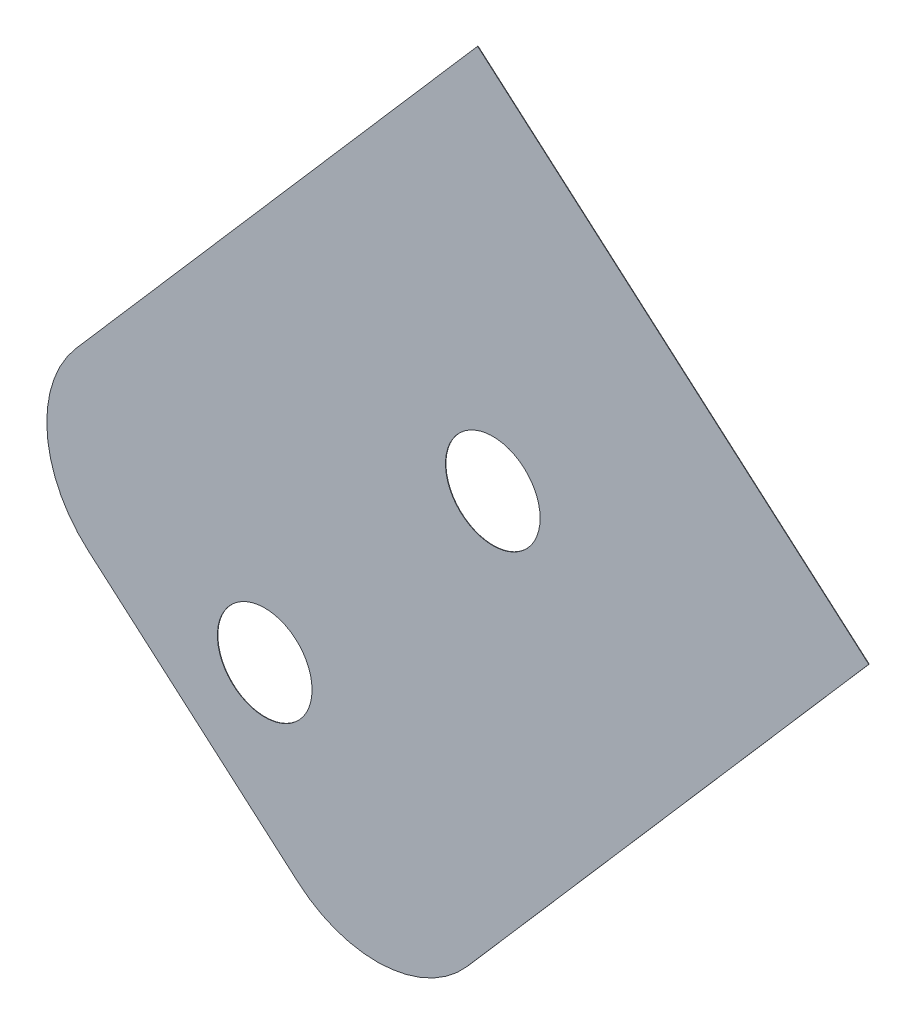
ISO-10303-21;
HEADER;
FILE_DESCRIPTION(('STEP AP214'),'2;1');
FILE_NAME('part.step','',(''),(''),'','','');
FILE_SCHEMA(('AUTOMOTIVE_DESIGN { 1 0 10303 214 1 1 1 1 }'));
ENDSEC;
DATA;
#1=APPLICATION_CONTEXT('core data for automotive mechanical design processes');
#2=APPLICATION_PROTOCOL_DEFINITION('international standard','automotive_design',2000,#1);
#3=PRODUCT_CONTEXT('',#1,'mechanical');
#4=PRODUCT('Part','Part','',(#3));
#5=PRODUCT_RELATED_PRODUCT_CATEGORY('part','',(#4));
#6=PRODUCT_DEFINITION_FORMATION('','',#4);
#7=PRODUCT_DEFINITION_CONTEXT('part definition',#1,'design');
#8=PRODUCT_DEFINITION('design','',#6,#7);
#9=PRODUCT_DEFINITION_SHAPE('','',#8);
#10=(LENGTH_UNIT() NAMED_UNIT(*) SI_UNIT(.MILLI.,.METRE.));
#11=(NAMED_UNIT(*) PLANE_ANGLE_UNIT() SI_UNIT($,.RADIAN.));
#12=(NAMED_UNIT(*) SI_UNIT($,.STERADIAN.) SOLID_ANGLE_UNIT());
#13=UNCERTAINTY_MEASURE_WITH_UNIT(LENGTH_MEASURE(1.E-05),#10,'distance_accuracy_value','');
#14=(GEOMETRIC_REPRESENTATION_CONTEXT(3) GLOBAL_UNCERTAINTY_ASSIGNED_CONTEXT((#13)) GLOBAL_UNIT_ASSIGNED_CONTEXT((#10,
#11,#12)) REPRESENTATION_CONTEXT('',''));
#15=CARTESIAN_POINT('',(0.,0.,0.));
#16=DIRECTION('',(0.,0.,1.));
#17=DIRECTION('',(1.,0.,0.));
#18=AXIS2_PLACEMENT_3D('',#15,#16,#17);
#19=CARTESIAN_POINT('',(-682.910085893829,-108.748616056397,0.0254000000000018));
#20=DIRECTION('',(-0.755030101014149,0.655690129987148,0.));
#21=DIRECTION('',(-0.655690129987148,-0.755030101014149,0.));
#22=AXIS2_PLACEMENT_3D('',#19,#20,#21);
#23=PLANE('',#22);
#24=DIRECTION('',(0.655690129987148,0.755030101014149,0.));
#25=VECTOR('',#24,1.);
#26=CARTESIAN_POINT('',(-682.910085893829,-108.748616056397,0.));
#27=LINE('',#26,#25);
#28=CARTESIAN_POINT('',(-682.910085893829,-108.748616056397,0.));
#29=VERTEX_POINT('',#28);
#30=CARTESIAN_POINT('',(-659.094108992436,-81.3244127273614,0.));
#31=VERTEX_POINT('',#30);
#32=EDGE_CURVE('E135',#29,#31,#27,.T.);
#33=ORIENTED_EDGE('',*,*,#32,.T.);
#34=DIRECTION('',(0.,0.,-1.));
#35=VECTOR('',#34,1.);
#36=CARTESIAN_POINT('',(-659.094108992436,-81.3244127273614,0.0254000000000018));
#37=LINE('',#36,#35);
#38=CARTESIAN_POINT('',(-659.094108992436,-81.3244127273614,0.0254000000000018));
#39=VERTEX_POINT('',#38);
#40=EDGE_CURVE('E11',#39,#31,#37,.T.);
#41=ORIENTED_EDGE('',*,*,#40,.F.);
#42=DIRECTION('',(0.655690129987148,0.755030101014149,0.));
#43=VECTOR('',#42,1.);
#44=CARTESIAN_POINT('',(-682.910085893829,-108.748616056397,0.0254000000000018));
#45=LINE('',#44,#43);
#46=CARTESIAN_POINT('',(-682.910085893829,-108.748616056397,0.0254000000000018));
#47=VERTEX_POINT('',#46);
#48=EDGE_CURVE('E152',#47,#39,#45,.T.);
#49=ORIENTED_EDGE('',*,*,#48,.F.);
#50=DIRECTION('',(0.,0.,-1.));
#51=VECTOR('',#50,1.);
#52=CARTESIAN_POINT('',(-682.910085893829,-108.748616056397,0.0254000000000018));
#53=LINE('',#52,#51);
#54=EDGE_CURVE('E131',#47,#29,#53,.T.);
#55=ORIENTED_EDGE('',*,*,#54,.T.);
#56=EDGE_LOOP('',(#33,#41,#49,#55));
#57=FACE_BOUND('',#56,.T.);
#58=ADVANCED_FACE('F45',(#57),#23,.F.);
#59=CARTESIAN_POINT('',(-659.094108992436,-81.3244127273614,0.0254000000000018));
#60=DIRECTION('',(-0.655690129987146,-0.755030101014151,0.));
#61=DIRECTION('',(0.755030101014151,-0.655690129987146,0.));
#62=AXIS2_PLACEMENT_3D('',#59,#60,#61);
#63=PLANE('',#62);
#64=DIRECTION('',(-0.755030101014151,0.655690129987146,0.));
#65=VECTOR('',#64,1.);
#66=CARTESIAN_POINT('',(-659.094108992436,-81.3244127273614,0.));
#67=LINE('',#66,#65);
#68=CARTESIAN_POINT('',(-682.299204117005,-61.1724322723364,0.));
#69=VERTEX_POINT('',#68);
#70=EDGE_CURVE('E139',#31,#69,#67,.T.);
#71=ORIENTED_EDGE('',*,*,#70,.T.);
#72=DIRECTION('',(0.,0.,-1.));
#73=VECTOR('',#72,1.);
#74=CARTESIAN_POINT('',(-682.299204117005,-61.1724322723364,0.0254000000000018));
#75=LINE('',#74,#73);
#76=CARTESIAN_POINT('',(-682.299204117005,-61.1724322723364,0.0254000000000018));
#77=VERTEX_POINT('',#76);
#78=EDGE_CURVE('E54',#77,#69,#75,.T.);
#79=ORIENTED_EDGE('',*,*,#78,.F.);
#80=DIRECTION('',(-0.755030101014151,0.655690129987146,0.));
#81=VECTOR('',#80,1.);
#82=CARTESIAN_POINT('',(-659.094108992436,-81.3244127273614,0.0254000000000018));
#83=LINE('',#82,#81);
#84=EDGE_CURVE('E99',#39,#77,#83,.T.);
#85=ORIENTED_EDGE('',*,*,#84,.F.);
#86=ORIENTED_EDGE('',*,*,#40,.T.);
#87=EDGE_LOOP('',(#71,#79,#85,#86));
#88=FACE_BOUND('',#87,.T.);
#89=ADVANCED_FACE('F182',(#88),#63,.F.);
#90=CARTESIAN_POINT('',(-682.299204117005,-61.1724322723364,0.0254000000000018));
#91=DIRECTION('',(0.75503010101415,-0.655690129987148,0.));
#92=DIRECTION('',(0.655690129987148,0.75503010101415,0.));
#93=AXIS2_PLACEMENT_3D('',#90,#91,#92);
#94=PLANE('',#93);
#95=DIRECTION('',(-0.655690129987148,-0.75503010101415,0.));
#96=VECTOR('',#95,1.);
#97=CARTESIAN_POINT('',(-682.299204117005,-61.1724322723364,0.));
#98=LINE('',#97,#96);
#99=CARTESIAN_POINT('',(-706.115181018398,-88.5966356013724,0.));
#100=VERTEX_POINT('',#99);
#101=EDGE_CURVE('E143',#69,#100,#98,.T.);
#102=ORIENTED_EDGE('',*,*,#101,.T.);
#103=DIRECTION('',(0.,0.,-1.));
#104=VECTOR('',#103,1.);
#105=CARTESIAN_POINT('',(-706.115181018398,-88.5966356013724,0.0254000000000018));
#106=LINE('',#105,#104);
#107=CARTESIAN_POINT('',(-706.115181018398,-88.5966356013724,0.0254000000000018));
#108=VERTEX_POINT('',#107);
#109=EDGE_CURVE('E123',#108,#100,#106,.T.);
#110=ORIENTED_EDGE('',*,*,#109,.F.);
#111=DIRECTION('',(-0.655690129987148,-0.75503010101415,0.));
#112=VECTOR('',#111,1.);
#113=CARTESIAN_POINT('',(-682.299204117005,-61.1724322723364,0.0254000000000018));
#114=LINE('',#113,#112);
#115=EDGE_CURVE('E112',#77,#108,#114,.T.);
#116=ORIENTED_EDGE('',*,*,#115,.F.);
#117=ORIENTED_EDGE('',*,*,#78,.T.);
#118=EDGE_LOOP('',(#102,#110,#116,#117));
#119=FACE_BOUND('',#118,.T.);
#120=ADVANCED_FACE('F163',(#119),#94,.F.);
#121=CARTESIAN_POINT('',(-700.745406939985,-93.259903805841,0.0254000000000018));
#122=DIRECTION('',(0.,0.,-1.));
#123=DIRECTION('',(-1.,0.,0.));
#124=AXIS2_PLACEMENT_3D('',#121,#122,#123);
#125=CYLINDRICAL_SURFACE('',#124,7.11200000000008);
#126=CARTESIAN_POINT('',(-700.745406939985,-93.259903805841,0.));
#127=DIRECTION('',(0.,0.,1.));
#128=DIRECTION('',(1.,0.,0.));
#129=AXIS2_PLACEMENT_3D('',#126,#127,#128);
#130=CIRCLE('',#129,7.11200000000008);
#131=CARTESIAN_POINT('',(-705.408675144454,-98.6296778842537,0.));
#132=VERTEX_POINT('',#131);
#133=EDGE_CURVE('E121',#100,#132,#130,.T.);
#134=ORIENTED_EDGE('',*,*,#133,.T.);
#135=DIRECTION('',(0.,0.,-1.));
#136=VECTOR('',#135,1.);
#137=CARTESIAN_POINT('',(-705.408675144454,-98.6296778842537,0.0254000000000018));
#138=LINE('',#137,#136);
#139=CARTESIAN_POINT('',(-705.408675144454,-98.6296778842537,0.0254000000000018));
#140=VERTEX_POINT('',#139);
#141=EDGE_CURVE('E118',#140,#132,#138,.T.);
#142=ORIENTED_EDGE('',*,*,#141,.F.);
#143=CARTESIAN_POINT('',(-700.745406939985,-93.259903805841,0.0254000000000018));
#144=DIRECTION('',(0.,0.,1.));
#145=DIRECTION('',(1.,0.,0.));
#146=AXIS2_PLACEMENT_3D('',#143,#144,#145);
#147=CIRCLE('',#146,7.11200000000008);
#148=EDGE_CURVE('E106',#108,#140,#147,.T.);
#149=ORIENTED_EDGE('',*,*,#148,.F.);
#150=ORIENTED_EDGE('',*,*,#109,.T.);
#151=EDGE_LOOP('',(#134,#142,#149,#150));
#152=FACE_BOUND('',#151,.T.);
#153=ADVANCED_FACE('F119',(#152),#125,.T.);
#154=CARTESIAN_POINT('',(-705.408675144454,-98.6296778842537,0.0254000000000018));
#155=DIRECTION('',(0.655690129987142,0.755030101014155,0.));
#156=DIRECTION('',(-0.755030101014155,0.655690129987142,0.));
#157=AXIS2_PLACEMENT_3D('',#154,#155,#156);
#158=PLANE('',#157);
#159=DIRECTION('',(0.755030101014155,-0.655690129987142,0.));
#160=VECTOR('',#159,1.);
#161=CARTESIAN_POINT('',(-705.408675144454,-98.6296778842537,0.));
#162=LINE('',#161,#160);
#163=CARTESIAN_POINT('',(-692.94312817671,-109.455121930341,0.));
#164=VERTEX_POINT('',#163);
#165=EDGE_CURVE('E85',#132,#164,#162,.T.);
#166=ORIENTED_EDGE('',*,*,#165,.T.);
#167=DIRECTION('',(0.,0.,-1.));
#168=VECTOR('',#167,1.);
#169=CARTESIAN_POINT('',(-692.94312817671,-109.455121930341,0.0254000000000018));
#170=LINE('',#169,#168);
#171=CARTESIAN_POINT('',(-692.94312817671,-109.455121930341,0.0254000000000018));
#172=VERTEX_POINT('',#171);
#173=EDGE_CURVE('E124',#172,#164,#170,.T.);
#174=ORIENTED_EDGE('',*,*,#173,.F.);
#175=DIRECTION('',(0.755030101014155,-0.655690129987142,0.));
#176=VECTOR('',#175,1.);
#177=CARTESIAN_POINT('',(-705.408675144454,-98.6296778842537,0.0254000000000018));
#178=LINE('',#177,#176);
#179=EDGE_CURVE('E110',#140,#172,#178,.T.);
#180=ORIENTED_EDGE('',*,*,#179,.F.);
#181=ORIENTED_EDGE('',*,*,#141,.T.);
#182=EDGE_LOOP('',(#166,#174,#180,#181));
#183=FACE_BOUND('',#182,.T.);
#184=ADVANCED_FACE('F126',(#183),#158,.F.);
#185=CARTESIAN_POINT('',(-688.279859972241,-104.085347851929,0.0254000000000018));
#186=DIRECTION('',(0.,0.,-1.));
#187=DIRECTION('',(-1.,0.,0.));
#188=AXIS2_PLACEMENT_3D('',#185,#186,#187);
#189=CYLINDRICAL_SURFACE('',#188,7.11199999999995);
#190=CARTESIAN_POINT('',(-688.279859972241,-104.085347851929,0.));
#191=DIRECTION('',(0.,0.,1.));
#192=DIRECTION('',(1.,0.,0.));
#193=AXIS2_PLACEMENT_3D('',#190,#191,#192);
#194=CIRCLE('',#193,7.11199999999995);
#195=EDGE_CURVE('E91',#164,#29,#194,.T.);
#196=ORIENTED_EDGE('',*,*,#195,.T.);
#197=ORIENTED_EDGE('',*,*,#54,.F.);
#198=CARTESIAN_POINT('',(-688.279859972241,-104.085347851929,0.0254000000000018));
#199=DIRECTION('',(0.,0.,1.));
#200=DIRECTION('',(1.,0.,0.));
#201=AXIS2_PLACEMENT_3D('',#198,#199,#200);
#202=CIRCLE('',#201,7.11199999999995);
#203=EDGE_CURVE('E62',#172,#47,#202,.T.);
#204=ORIENTED_EDGE('',*,*,#203,.F.);
#205=ORIENTED_EDGE('',*,*,#173,.T.);
#206=EDGE_LOOP('',(#196,#197,#204,#205));
#207=FACE_BOUND('',#206,.T.);
#208=ADVANCED_FACE('F170',(#207),#189,.T.);
#209=CARTESIAN_POINT('',(-700.745406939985,-93.259903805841,0.0254000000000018));
#210=DIRECTION('',(0.,0.,1.));
#211=DIRECTION('',(1.,0.,0.));
#212=AXIS2_PLACEMENT_3D('',#209,#210,#211);
#213=PLANE('',#212);
#214=CARTESIAN_POINT('',(-681.397191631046,-83.5701362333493,0.0254000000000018));
#215=DIRECTION('',(0.,0.,1.));
#216=DIRECTION('',(1.,0.,0.));
#217=AXIS2_PLACEMENT_3D('',#214,#215,#216);
#218=CIRCLE('',#217,2.80670000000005);
#219=CARTESIAN_POINT('',(-678.590491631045,-83.5701362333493,0.0254000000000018));
#220=VERTEX_POINT('',#219);
#221=EDGE_CURVE('E253',#220,#220,#218,.T.);
#222=ORIENTED_EDGE('',*,*,#221,.F.);
#223=EDGE_LOOP('',(#222));
#224=FACE_BOUND('',#223,.T.);
#225=CARTESIAN_POINT('',(-694.928996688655,-99.1520699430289,0.0254000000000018));
#226=DIRECTION('',(0.,0.,1.));
#227=DIRECTION('',(1.,0.,0.));
#228=AXIS2_PLACEMENT_3D('',#225,#226,#227);
#229=CIRCLE('',#228,2.80670000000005);
#230=CARTESIAN_POINT('',(-692.122296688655,-99.1520699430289,0.0254000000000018));
#231=VERTEX_POINT('',#230);
#232=EDGE_CURVE('E140',#231,#231,#229,.T.);
#233=ORIENTED_EDGE('',*,*,#232,.F.);
#234=EDGE_LOOP('',(#233));
#235=FACE_BOUND('',#234,.T.);
#236=ORIENTED_EDGE('',*,*,#48,.T.);
#237=ORIENTED_EDGE('',*,*,#84,.T.);
#238=ORIENTED_EDGE('',*,*,#115,.T.);
#239=ORIENTED_EDGE('',*,*,#148,.T.);
#240=ORIENTED_EDGE('',*,*,#179,.T.);
#241=ORIENTED_EDGE('',*,*,#203,.T.);
#242=EDGE_LOOP('',(#236,#237,#238,#239,#240,#241));
#243=FACE_BOUND('',#242,.T.);
#244=ADVANCED_FACE('F108',(#224,#235,#243),#213,.T.);
#245=CARTESIAN_POINT('',(-700.745406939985,-93.259903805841,0.));
#246=DIRECTION('',(0.,0.,1.));
#247=DIRECTION('',(1.,0.,0.));
#248=AXIS2_PLACEMENT_3D('',#245,#246,#247);
#249=PLANE('',#248);
#250=CARTESIAN_POINT('',(-681.397191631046,-83.5701362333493,0.));
#251=DIRECTION('',(0.,0.,1.));
#252=DIRECTION('',(1.,0.,0.));
#253=AXIS2_PLACEMENT_3D('',#250,#251,#252);
#254=CIRCLE('',#253,2.80670000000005);
#255=CARTESIAN_POINT('',(-678.590491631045,-83.5701362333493,0.));
#256=VERTEX_POINT('',#255);
#257=EDGE_CURVE('E250',#256,#256,#254,.T.);
#258=ORIENTED_EDGE('',*,*,#257,.T.);
#259=EDGE_LOOP('',(#258));
#260=FACE_BOUND('',#259,.T.);
#261=CARTESIAN_POINT('',(-694.928996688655,-99.1520699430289,0.));
#262=DIRECTION('',(0.,0.,1.));
#263=DIRECTION('',(1.,0.,0.));
#264=AXIS2_PLACEMENT_3D('',#261,#262,#263);
#265=CIRCLE('',#264,2.80670000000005);
#266=CARTESIAN_POINT('',(-692.122296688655,-99.1520699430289,0.));
#267=VERTEX_POINT('',#266);
#268=EDGE_CURVE('E255',#267,#267,#265,.T.);
#269=ORIENTED_EDGE('',*,*,#268,.T.);
#270=EDGE_LOOP('',(#269));
#271=FACE_BOUND('',#270,.T.);
#272=ORIENTED_EDGE('',*,*,#32,.F.);
#273=ORIENTED_EDGE('',*,*,#195,.F.);
#274=ORIENTED_EDGE('',*,*,#165,.F.);
#275=ORIENTED_EDGE('',*,*,#133,.F.);
#276=ORIENTED_EDGE('',*,*,#101,.F.);
#277=ORIENTED_EDGE('',*,*,#70,.F.);
#278=EDGE_LOOP('',(#272,#273,#274,#275,#276,#277));
#279=FACE_BOUND('',#278,.T.);
#280=ADVANCED_FACE('F166',(#260,#271,#279),#249,.F.);
#281=CARTESIAN_POINT('',(-694.928996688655,-99.1520699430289,0.0254000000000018));
#282=DIRECTION('',(0.,0.,1.));
#283=DIRECTION('',(1.,0.,0.));
#284=AXIS2_PLACEMENT_3D('',#281,#282,#283);
#285=CYLINDRICAL_SURFACE('',#284,2.80670000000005);
#286=ORIENTED_EDGE('',*,*,#268,.F.);
#287=EDGE_LOOP('',(#286));
#288=FACE_BOUND('',#287,.T.);
#289=ORIENTED_EDGE('',*,*,#232,.T.);
#290=EDGE_LOOP('',(#289));
#291=FACE_BOUND('',#290,.T.);
#292=ADVANCED_FACE('F221',(#288,#291),#285,.F.);
#293=CARTESIAN_POINT('',(-681.397191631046,-83.5701362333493,0.0254000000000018));
#294=DIRECTION('',(0.,0.,1.));
#295=DIRECTION('',(1.,0.,0.));
#296=AXIS2_PLACEMENT_3D('',#293,#294,#295);
#297=CYLINDRICAL_SURFACE('',#296,2.80670000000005);
#298=ORIENTED_EDGE('',*,*,#257,.F.);
#299=EDGE_LOOP('',(#298));
#300=FACE_BOUND('',#299,.T.);
#301=ORIENTED_EDGE('',*,*,#221,.T.);
#302=EDGE_LOOP('',(#301));
#303=FACE_BOUND('',#302,.T.);
#304=ADVANCED_FACE('F231',(#300,#303),#297,.F.);
#305=CLOSED_SHELL('',(#58,#89,#120,#153,#184,#208,#244,#280,#292,#304));
#306=MANIFOLD_SOLID_BREP('B2',#305);
#307=ADVANCED_BREP_SHAPE_REPRESENTATION('',(#18,#306),#14);
#308=SHAPE_DEFINITION_REPRESENTATION(#9,#307);
ENDSEC;
END-ISO-10303-21;
